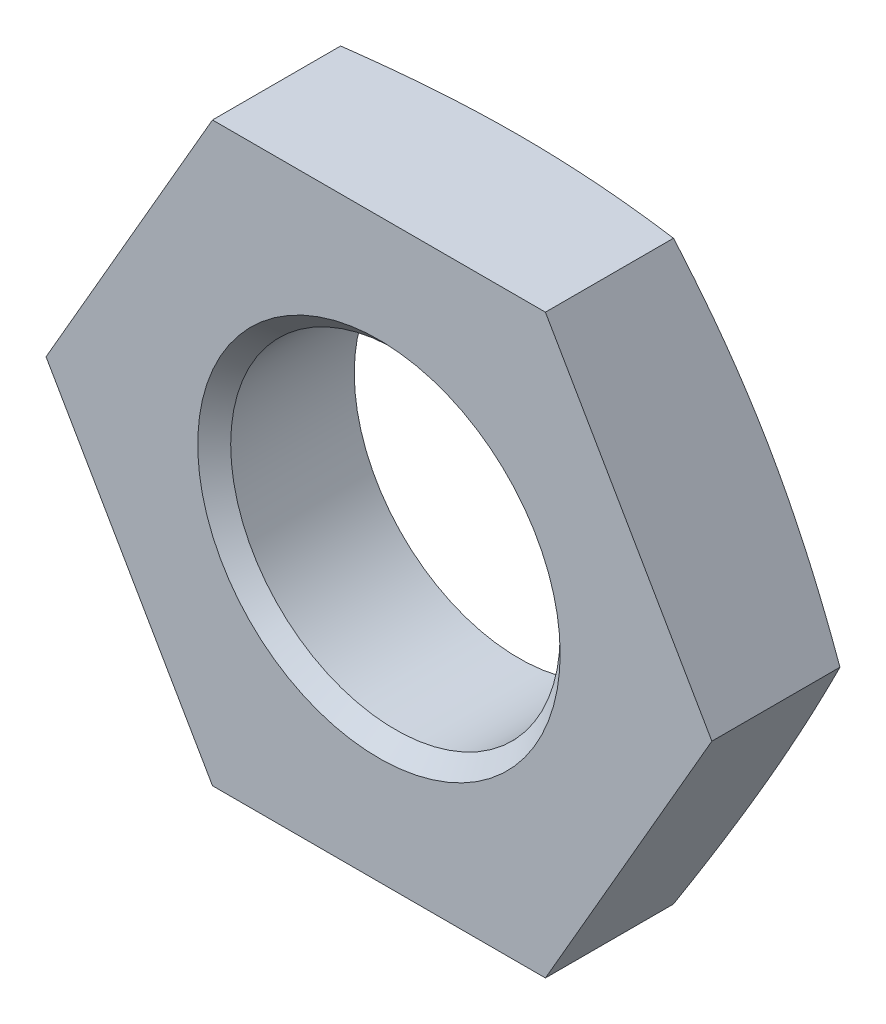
ISO-10303-21;
HEADER;
FILE_DESCRIPTION(('STEP AP214'),'2;1');
FILE_NAME('part.step','',(''),(''),'','','');
FILE_SCHEMA(('AUTOMOTIVE_DESIGN { 1 0 10303 214 1 1 1 1 }'));
ENDSEC;
DATA;
#1=APPLICATION_CONTEXT('core data for automotive mechanical design processes');
#2=APPLICATION_PROTOCOL_DEFINITION('international standard','automotive_design',2000,#1);
#3=PRODUCT_CONTEXT('',#1,'mechanical');
#4=PRODUCT('Part','Part','',(#3));
#5=PRODUCT_RELATED_PRODUCT_CATEGORY('part','',(#4));
#6=PRODUCT_DEFINITION_FORMATION('','',#4);
#7=PRODUCT_DEFINITION_CONTEXT('part definition',#1,'design');
#8=PRODUCT_DEFINITION('design','',#6,#7);
#9=PRODUCT_DEFINITION_SHAPE('','',#8);
#10=(LENGTH_UNIT() NAMED_UNIT(*) SI_UNIT(.MILLI.,.METRE.));
#11=(NAMED_UNIT(*) PLANE_ANGLE_UNIT() SI_UNIT($,.RADIAN.));
#12=(NAMED_UNIT(*) SI_UNIT($,.STERADIAN.) SOLID_ANGLE_UNIT());
#13=UNCERTAINTY_MEASURE_WITH_UNIT(LENGTH_MEASURE(1.E-05),#10,'distance_accuracy_value','');
#14=(GEOMETRIC_REPRESENTATION_CONTEXT(3) GLOBAL_UNCERTAINTY_ASSIGNED_CONTEXT((#13)) GLOBAL_UNIT_ASSIGNED_CONTEXT((#10,
#11,#12)) REPRESENTATION_CONTEXT('',''));
#15=CARTESIAN_POINT('',(0.,0.,0.));
#16=DIRECTION('',(0.,0.,1.));
#17=DIRECTION('',(1.,0.,0.));
#18=AXIS2_PLACEMENT_3D('',#15,#16,#17);
#19=CARTESIAN_POINT('',(-2.02072594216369,-3.5,-1.7));
#20=DIRECTION('',(0.,-1.,0.));
#21=DIRECTION('',(0.,0.,-1.));
#22=AXIS2_PLACEMENT_3D('',#19,#20,#21);
#23=PLANE('',#22);
#24=CARTESIAN_POINT('',(-5.34250540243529,-3.5,-0.926460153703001));
#25=CARTESIAN_POINT('',(-5.18375511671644,-3.5,-0.962032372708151));
#26=CARTESIAN_POINT('',(-5.02490552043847,-3.5,-0.997168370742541));
#27=CARTESIAN_POINT('',(-4.70695877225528,-3.5,-1.06633415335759));
#28=CARTESIAN_POINT('',(-4.5478616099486,-3.5,-1.10036389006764));
#29=CARTESIAN_POINT('',(-4.22922785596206,-3.5,-1.16711307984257));
#30=CARTESIAN_POINT('',(-4.06969098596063,-3.5,-1.1998312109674));
#31=CARTESIAN_POINT('',(-3.75028550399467,-3.5,-1.26359691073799));
#32=CARTESIAN_POINT('',(-3.59041689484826,-3.5,-1.29464449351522));
#33=CARTESIAN_POINT('',(-3.11278775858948,-3.5,-1.38424317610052));
#34=CARTESIAN_POINT('',(-2.7944536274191,-3.5,-1.4397960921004));
#35=CARTESIAN_POINT('',(-2.15584280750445,-3.5,-1.53857753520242));
#36=CARTESIAN_POINT('',(-1.83556646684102,-3.5,-1.58180820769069));
#37=CARTESIAN_POINT('',(-1.35186201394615,-3.5,-1.63326780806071));
#38=CARTESIAN_POINT('',(-1.18915391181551,-3.5,-1.64823562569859));
#39=CARTESIAN_POINT('',(-0.863327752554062,-3.5,-1.67279914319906));
#40=CARTESIAN_POINT('',(-0.700209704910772,-3.5,-1.6823949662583));
#41=CARTESIAN_POINT('',(-0.373802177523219,-3.5,-1.69565632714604));
#42=CARTESIAN_POINT('',(-0.210512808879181,-3.5,-1.69932454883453));
#43=CARTESIAN_POINT('',(0.116088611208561,-3.5,-1.70050481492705));
#44=CARTESIAN_POINT('',(0.27940066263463,-3.5,-1.69801686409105));
#45=CARTESIAN_POINT('',(0.60640968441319,-3.5,-1.68702500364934));
#46=CARTESIAN_POINT('',(0.77010590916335,-3.5,-1.67849935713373));
#47=CARTESIAN_POINT('',(1.09711815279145,-3.5,-1.65591780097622));
#48=CARTESIAN_POINT('',(1.26043415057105,-3.5,-1.64186159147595));
#49=CARTESIAN_POINT('',(1.58667719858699,-3.5,-1.60892981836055));
#50=CARTESIAN_POINT('',(1.74960393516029,-3.5,-1.59005119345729));
#51=CARTESIAN_POINT('',(2.07493184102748,-3.5,-1.54825406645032));
#52=CARTESIAN_POINT('',(2.23733300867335,-3.5,-1.52533555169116));
#53=CARTESIAN_POINT('',(2.70201244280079,-3.5,-1.45494463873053));
#54=CARTESIAN_POINT('',(3.00366965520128,-3.5,-1.40339226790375));
#55=CARTESIAN_POINT('',(3.60558094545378,-3.5,-1.29266255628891));
#56=CARTESIAN_POINT('',(3.90583484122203,-3.5,-1.2334842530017));
#57=CARTESIAN_POINT('',(4.50535507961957,-3.5,-1.11000595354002));
#58=CARTESIAN_POINT('',(4.80462116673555,-3.5,-1.04570472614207));
#59=CARTESIAN_POINT('',(5.40235855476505,-3.5,-0.913615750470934));
#60=CARTESIAN_POINT('',(5.70082990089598,-3.5,-0.845828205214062));
#61=CARTESIAN_POINT('',(6.29427282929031,-3.5,-0.708480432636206));
#62=CARTESIAN_POINT('',(6.58924997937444,-3.5,-0.638944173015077));
#63=CARTESIAN_POINT('',(7.17879272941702,-3.5,-0.49812969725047));
#64=CARTESIAN_POINT('',(7.47335832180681,-3.5,-0.426851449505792));
#65=CARTESIAN_POINT('',(8.06181238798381,-3.5,-0.283096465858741));
#66=CARTESIAN_POINT('',(8.35570124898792,-3.5,-0.210621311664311));
#67=CARTESIAN_POINT('',(8.94322286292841,-3.5,-0.0646806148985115));
#68=CARTESIAN_POINT('',(9.23685562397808,-3.5,0.00878489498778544));
#69=CARTESIAN_POINT('',(9.53039909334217,-3.5,0.0826012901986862));
#70=B_SPLINE_CURVE_WITH_KNOTS('',3,(#24,#25,#26,#27,#28,#29,#30,#31,#32,#33,#34,#35,#36,#37,#38,
#39,#40,#41,#42,#43,#44,#45,#46,#47,#48,#49,#50,#51,#52,#53,#54,#55,#56,#57,#58,#59,#60,#61,#62,
#63,#64,#65,#66,#67,#68,#69),.UNSPECIFIED.,.F.,.F.,(4,2,2,2,2,2,2,2,2,2,2,2,2,2,2,2,2,2,2,2,2,2,
4),(0.,0.488062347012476,0.976145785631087,1.46470938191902,1.95326884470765,2.92256552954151,
3.8916933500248,4.38180449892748,4.8719044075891,5.36178234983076,5.85165991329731,
6.34331015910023,6.83498706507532,7.32697686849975,7.8189682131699,8.7368879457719,
9.65492364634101,10.5731806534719,11.491384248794,12.4005642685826,13.3097607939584,
14.2178391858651,15.1258876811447),.UNSPECIFIED.);
#71=CARTESIAN_POINT('',(2.02072594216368,-3.5,-1.55491840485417));
#72=VERTEX_POINT('',#71);
#73=CARTESIAN_POINT('',(0.,-3.5,-1.7));
#74=VERTEX_POINT('',#73);
#75=EDGE_CURVE('E206',#72,#74,#70,.F.);
#76=ORIENTED_EDGE('',*,*,#75,.F.);
#77=DIRECTION('',(0.,0.,1.));
#78=VECTOR('',#77,1.);
#79=CARTESIAN_POINT('',(2.02072594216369,-3.5,-1.7));
#80=LINE('',#79,#78);
#81=CARTESIAN_POINT('',(2.02072594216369,-3.5,0.));
#82=VERTEX_POINT('',#81);
#83=EDGE_CURVE('E229',#72,#82,#80,.T.);
#84=ORIENTED_EDGE('',*,*,#83,.T.);
#85=DIRECTION('',(1.,0.,0.));
#86=VECTOR('',#85,1.);
#87=CARTESIAN_POINT('',(-2.02072594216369,-3.5,0.));
#88=LINE('',#87,#86);
#89=CARTESIAN_POINT('',(-2.02072594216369,-3.5,0.));
#90=VERTEX_POINT('',#89);
#91=EDGE_CURVE('E211',#90,#82,#88,.T.);
#92=ORIENTED_EDGE('',*,*,#91,.F.);
#93=DIRECTION('',(0.,0.,1.));
#94=VECTOR('',#93,1.);
#95=CARTESIAN_POINT('',(-2.02072594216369,-3.5,-1.7));
#96=LINE('',#95,#94);
#97=CARTESIAN_POINT('',(-2.02072594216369,-3.5,-1.55491840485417));
#98=VERTEX_POINT('',#97);
#99=EDGE_CURVE('E58',#98,#90,#96,.T.);
#100=ORIENTED_EDGE('',*,*,#99,.F.);
#101=EDGE_CURVE('E201',#74,#98,#70,.F.);
#102=ORIENTED_EDGE('',*,*,#101,.F.);
#103=EDGE_LOOP('',(#76,#84,#92,#100,#102));
#104=FACE_BOUND('',#103,.T.);
#105=ADVANCED_FACE('F35',(#104),#23,.T.);
#106=CARTESIAN_POINT('',(-4.04145188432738,0.,-1.7));
#107=DIRECTION('',(-0.866025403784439,-0.5,0.));
#108=DIRECTION('',(0.5,-0.866025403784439,0.));
#109=AXIS2_PLACEMENT_3D('',#106,#107,#108);
#110=PLANE('',#109);
#111=CARTESIAN_POINT('',(-2.02061047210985,-3.5002,-1.55488746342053));
#112=CARTESIAN_POINT('',(-2.10453570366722,-3.35483723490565,-1.57738559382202));
#113=CARTESIAN_POINT('',(-2.18861311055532,-3.20921089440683,-1.59781025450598));
#114=CARTESIAN_POINT('',(-2.35706487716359,-2.91744387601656,-1.63369455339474));
#115=CARTESIAN_POINT('',(-2.44143934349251,-2.77130301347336,-1.64915217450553));
#116=CARTESIAN_POINT('',(-2.6099736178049,-2.47939308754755,-1.67419991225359));
#117=CARTESIAN_POINT('',(-2.69413228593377,-2.33362599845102,-1.68381990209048));
#118=CARTESIAN_POINT('',(-2.86255695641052,-2.04190591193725,-1.69671933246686));
#119=CARTESIAN_POINT('',(-2.94682293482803,-1.89595295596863,-1.7));
#120=CARTESIAN_POINT('',(-3.11535489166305,-1.60404704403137,-1.7));
#121=CARTESIAN_POINT('',(-3.19962087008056,-1.45809408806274,-1.69671933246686));
#122=CARTESIAN_POINT('',(-3.3680455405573,-1.16637400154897,-1.68381990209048));
#123=CARTESIAN_POINT('',(-3.45220420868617,-1.02060691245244,-1.67419991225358));
#124=CARTESIAN_POINT('',(-3.62073848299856,-0.728696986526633,-1.64915217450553));
#125=CARTESIAN_POINT('',(-3.70511294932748,-0.582556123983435,-1.63369455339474));
#126=CARTESIAN_POINT('',(-3.87356471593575,-0.29078910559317,-1.59781025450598));
#127=CARTESIAN_POINT('',(-3.95764212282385,-0.145162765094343,-1.57738559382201));
#128=CARTESIAN_POINT('',(-4.04156735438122,0.000200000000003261,-1.55488746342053));
#129=B_SPLINE_CURVE_WITH_KNOTS('',3,(#111,#112,#113,#114,#115,#116,#117,#118,#119,#120,#121,
#122,#123,#124,#125,#126,#127,#128),.UNSPECIFIED.,.F.,.F.,(4,2,2,2,2,2,2,2,4),(0.,
0.508081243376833,1.016368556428,1.52203235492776,2.02759827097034,2.53316418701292,
3.03882798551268,3.54711529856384,4.05519654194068),.UNSPECIFIED.);
#130=CARTESIAN_POINT('',(-3.03108891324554,-1.75,-1.7));
#131=VERTEX_POINT('',#130);
#132=EDGE_CURVE('E207',#98,#131,#129,.T.);
#133=ORIENTED_EDGE('',*,*,#132,.F.);
#134=ORIENTED_EDGE('',*,*,#99,.T.);
#135=DIRECTION('',(0.5,-0.866025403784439,0.));
#136=VECTOR('',#135,1.);
#137=CARTESIAN_POINT('',(-4.04145188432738,0.,0.));
#138=LINE('',#137,#136);
#139=CARTESIAN_POINT('',(-4.04145188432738,0.,0.));
#140=VERTEX_POINT('',#139);
#141=EDGE_CURVE('E226',#140,#90,#138,.T.);
#142=ORIENTED_EDGE('',*,*,#141,.F.);
#143=DIRECTION('',(0.,0.,1.));
#144=VECTOR('',#143,1.);
#145=CARTESIAN_POINT('',(-4.04145188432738,0.,-1.7));
#146=LINE('',#145,#144);
#147=CARTESIAN_POINT('',(-4.04145188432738,0.,-1.55491840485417));
#148=VERTEX_POINT('',#147);
#149=EDGE_CURVE('E231',#148,#140,#146,.T.);
#150=ORIENTED_EDGE('',*,*,#149,.F.);
#151=EDGE_CURVE('E117',#131,#148,#129,.T.);
#152=ORIENTED_EDGE('',*,*,#151,.F.);
#153=EDGE_LOOP('',(#133,#134,#142,#150,#152));
#154=FACE_BOUND('',#153,.T.);
#155=ADVANCED_FACE('F199',(#154),#110,.T.);
#156=CARTESIAN_POINT('',(-2.02072594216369,3.5,-1.7));
#157=DIRECTION('',(-0.866025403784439,0.5,0.));
#158=DIRECTION('',(-0.5,-0.866025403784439,0.));
#159=AXIS2_PLACEMENT_3D('',#156,#157,#158);
#160=PLANE('',#159);
#161=CARTESIAN_POINT('',(-4.04156735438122,-0.00019999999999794,-1.55488746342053));
#162=CARTESIAN_POINT('',(-3.95764212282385,0.145162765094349,-1.57738559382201));
#163=CARTESIAN_POINT('',(-3.87356471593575,0.290789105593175,-1.59781025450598));
#164=CARTESIAN_POINT('',(-3.70511294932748,0.58255612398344,-1.63369455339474));
#165=CARTESIAN_POINT('',(-3.62073848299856,0.728696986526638,-1.64915217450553));
#166=CARTESIAN_POINT('',(-3.45220420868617,1.02060691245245,-1.67419991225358));
#167=CARTESIAN_POINT('',(-3.3680455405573,1.16637400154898,-1.68381990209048));
#168=CARTESIAN_POINT('',(-3.19962087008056,1.45809408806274,-1.69671933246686));
#169=CARTESIAN_POINT('',(-3.11535489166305,1.60404704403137,-1.7));
#170=CARTESIAN_POINT('',(-2.94682293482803,1.89595295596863,-1.7));
#171=CARTESIAN_POINT('',(-2.86255695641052,2.04190591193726,-1.69671933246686));
#172=CARTESIAN_POINT('',(-2.69413228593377,2.33362599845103,-1.68381990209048));
#173=CARTESIAN_POINT('',(-2.6099736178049,2.47939308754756,-1.67419991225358));
#174=CARTESIAN_POINT('',(-2.44143934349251,2.77130301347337,-1.64915217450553));
#175=CARTESIAN_POINT('',(-2.35706487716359,2.91744387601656,-1.63369455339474));
#176=CARTESIAN_POINT('',(-2.18861311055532,3.20921089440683,-1.59781025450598));
#177=CARTESIAN_POINT('',(-2.10453570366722,3.35483723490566,-1.57738559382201));
#178=CARTESIAN_POINT('',(-2.02061047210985,3.5002,-1.55488746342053));
#179=B_SPLINE_CURVE_WITH_KNOTS('',3,(#161,#162,#163,#164,#165,#166,#167,#168,#169,#170,#171,
#172,#173,#174,#175,#176,#177,#178),.UNSPECIFIED.,.F.,.F.,(4,2,2,2,2,2,2,2,4),(0.,
0.508081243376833,1.01636855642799,1.52203235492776,2.02759827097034,2.53316418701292,
3.03882798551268,3.54711529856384,4.05519654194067),.UNSPECIFIED.);
#180=CARTESIAN_POINT('',(-3.03108891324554,1.75,-1.7));
#181=VERTEX_POINT('',#180);
#182=EDGE_CURVE('E110',#148,#181,#179,.T.);
#183=ORIENTED_EDGE('',*,*,#182,.F.);
#184=ORIENTED_EDGE('',*,*,#149,.T.);
#185=DIRECTION('',(-0.5,-0.866025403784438,0.));
#186=VECTOR('',#185,1.);
#187=CARTESIAN_POINT('',(-2.02072594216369,3.5,0.));
#188=LINE('',#187,#186);
#189=CARTESIAN_POINT('',(-2.02072594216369,3.5,0.));
#190=VERTEX_POINT('',#189);
#191=EDGE_CURVE('E223',#190,#140,#188,.T.);
#192=ORIENTED_EDGE('',*,*,#191,.F.);
#193=DIRECTION('',(0.,0.,1.));
#194=VECTOR('',#193,1.);
#195=CARTESIAN_POINT('',(-2.02072594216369,3.5,-1.7));
#196=LINE('',#195,#194);
#197=CARTESIAN_POINT('',(-2.02072594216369,3.5,-1.55491840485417));
#198=VERTEX_POINT('',#197);
#199=EDGE_CURVE('E141',#198,#190,#196,.T.);
#200=ORIENTED_EDGE('',*,*,#199,.F.);
#201=EDGE_CURVE('E121',#181,#198,#179,.T.);
#202=ORIENTED_EDGE('',*,*,#201,.F.);
#203=EDGE_LOOP('',(#183,#184,#192,#200,#202));
#204=FACE_BOUND('',#203,.T.);
#205=ADVANCED_FACE('F139',(#204),#160,.T.);
#206=CARTESIAN_POINT('',(2.02072594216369,3.5,-1.7));
#207=DIRECTION('',(0.,1.,0.));
#208=DIRECTION('',(0.,0.,1.));
#209=AXIS2_PLACEMENT_3D('',#206,#207,#208);
#210=PLANE('',#209);
#211=CARTESIAN_POINT('',(-5.34250540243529,3.5,-0.926460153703));
#212=CARTESIAN_POINT('',(-5.18375511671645,3.5,-0.962032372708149));
#213=CARTESIAN_POINT('',(-5.02490552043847,3.5,-0.997168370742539));
#214=CARTESIAN_POINT('',(-4.70695877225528,3.5,-1.06633415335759));
#215=CARTESIAN_POINT('',(-4.5478616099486,3.5,-1.10036389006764));
#216=CARTESIAN_POINT('',(-4.22922785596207,3.5,-1.16711307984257));
#217=CARTESIAN_POINT('',(-4.06969098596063,3.5,-1.1998312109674));
#218=CARTESIAN_POINT('',(-3.75028550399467,3.5,-1.26359691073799));
#219=CARTESIAN_POINT('',(-3.59041689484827,3.5,-1.29464449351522));
#220=CARTESIAN_POINT('',(-3.11278775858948,3.5,-1.38424317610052));
#221=CARTESIAN_POINT('',(-2.7944536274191,3.5,-1.4397960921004));
#222=CARTESIAN_POINT('',(-2.15584280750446,3.5,-1.53857753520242));
#223=CARTESIAN_POINT('',(-1.83556646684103,3.5,-1.58180820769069));
#224=CARTESIAN_POINT('',(-1.35186201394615,3.5,-1.63326780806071));
#225=CARTESIAN_POINT('',(-1.18915391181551,3.5,-1.64823562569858));
#226=CARTESIAN_POINT('',(-0.863327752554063,3.5,-1.67279914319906));
#227=CARTESIAN_POINT('',(-0.700209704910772,3.5,-1.68239496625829));
#228=CARTESIAN_POINT('',(-0.373802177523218,3.5,-1.69565632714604));
#229=CARTESIAN_POINT('',(-0.21051280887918,3.5,-1.69932454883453));
#230=CARTESIAN_POINT('',(0.116088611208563,3.5,-1.70050481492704));
#231=CARTESIAN_POINT('',(0.279400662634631,3.5,-1.69801686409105));
#232=CARTESIAN_POINT('',(0.606409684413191,3.5,-1.68702500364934));
#233=CARTESIAN_POINT('',(0.770105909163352,3.5,-1.67849935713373));
#234=CARTESIAN_POINT('',(1.09711815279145,3.5,-1.65591780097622));
#235=CARTESIAN_POINT('',(1.26043415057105,3.5,-1.64186159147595));
#236=CARTESIAN_POINT('',(1.58667719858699,3.5,-1.60892981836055));
#237=CARTESIAN_POINT('',(1.74960393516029,3.5,-1.59005119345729));
#238=CARTESIAN_POINT('',(2.07493184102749,3.5,-1.54825406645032));
#239=CARTESIAN_POINT('',(2.23733300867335,3.5,-1.52533555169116));
#240=CARTESIAN_POINT('',(2.7020124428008,3.5,-1.45494463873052));
#241=CARTESIAN_POINT('',(3.00366965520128,3.5,-1.40339226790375));
#242=CARTESIAN_POINT('',(3.60558094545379,3.5,-1.29266255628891));
#243=CARTESIAN_POINT('',(3.90583484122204,3.5,-1.2334842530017));
#244=CARTESIAN_POINT('',(4.50535507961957,3.5,-1.11000595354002));
#245=CARTESIAN_POINT('',(4.80462116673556,3.5,-1.04570472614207));
#246=CARTESIAN_POINT('',(5.40235855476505,3.5,-0.913615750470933));
#247=CARTESIAN_POINT('',(5.70082990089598,3.5,-0.84582820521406));
#248=CARTESIAN_POINT('',(6.29427282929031,3.5,-0.708480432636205));
#249=CARTESIAN_POINT('',(6.58924997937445,3.5,-0.638944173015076));
#250=CARTESIAN_POINT('',(7.17879272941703,3.5,-0.498129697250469));
#251=CARTESIAN_POINT('',(7.47335832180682,3.5,-0.426851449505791));
#252=CARTESIAN_POINT('',(8.06181238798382,3.5,-0.28309646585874));
#253=CARTESIAN_POINT('',(8.35570124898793,3.5,-0.21062131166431));
#254=CARTESIAN_POINT('',(8.94322286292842,3.5,-0.0646806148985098));
#255=CARTESIAN_POINT('',(9.23685562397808,3.5,0.00878489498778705));
#256=CARTESIAN_POINT('',(9.53039909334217,3.5,0.0826012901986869));
#257=B_SPLINE_CURVE_WITH_KNOTS('',3,(#211,#212,#213,#214,#215,#216,#217,#218,#219,#220,#221,
#222,#223,#224,#225,#226,#227,#228,#229,#230,#231,#232,#233,#234,#235,#236,#237,#238,#239,#240,
#241,#242,#243,#244,#245,#246,#247,#248,#249,#250,#251,#252,#253,#254,#255,#256),.UNSPECIFIED.,
.F.,.F.,(4,2,2,2,2,2,2,2,2,2,2,2,2,2,2,2,2,2,2,2,2,2,4),(0.,0.488062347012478,0.97614578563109,
1.46470938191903,1.95326884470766,2.92256552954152,3.8916933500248,4.38180449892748,
4.8719044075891,5.36178234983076,5.85165991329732,6.34331015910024,6.83498706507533,
7.32697686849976,7.81896821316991,8.73688794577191,9.65492364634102,10.5731806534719,
11.491384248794,12.4005642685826,13.3097607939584,14.2178391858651,15.1258876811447),.UNSPECIFIED.);
#258=CARTESIAN_POINT('',(0.,3.5,-1.7));
#259=VERTEX_POINT('',#258);
#260=EDGE_CURVE('E128',#198,#259,#257,.T.);
#261=ORIENTED_EDGE('',*,*,#260,.F.);
#262=ORIENTED_EDGE('',*,*,#199,.T.);
#263=DIRECTION('',(-1.,0.,0.));
#264=VECTOR('',#263,1.);
#265=CARTESIAN_POINT('',(2.02072594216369,3.5,0.));
#266=LINE('',#265,#264);
#267=CARTESIAN_POINT('',(2.02072594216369,3.5,0.));
#268=VERTEX_POINT('',#267);
#269=EDGE_CURVE('E220',#268,#190,#266,.T.);
#270=ORIENTED_EDGE('',*,*,#269,.F.);
#271=DIRECTION('',(0.,0.,1.));
#272=VECTOR('',#271,1.);
#273=CARTESIAN_POINT('',(2.02072594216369,3.5,-1.7));
#274=LINE('',#273,#272);
#275=CARTESIAN_POINT('',(2.02072594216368,3.50000000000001,-1.55491840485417));
#276=VERTEX_POINT('',#275);
#277=EDGE_CURVE('E234',#276,#268,#274,.T.);
#278=ORIENTED_EDGE('',*,*,#277,.F.);
#279=EDGE_CURVE('E142',#259,#276,#257,.T.);
#280=ORIENTED_EDGE('',*,*,#279,.F.);
#281=EDGE_LOOP('',(#261,#262,#270,#278,#280));
#282=FACE_BOUND('',#281,.T.);
#283=ADVANCED_FACE('F191',(#282),#210,.T.);
#284=CARTESIAN_POINT('',(4.04145188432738,0.,-1.7));
#285=DIRECTION('',(0.866025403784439,0.5,0.));
#286=DIRECTION('',(-0.5,0.866025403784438,0.));
#287=AXIS2_PLACEMENT_3D('',#284,#285,#286);
#288=PLANE('',#287);
#289=CARTESIAN_POINT('',(2.02061047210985,3.5002,-1.55488746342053));
#290=CARTESIAN_POINT('',(2.10453570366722,3.35483723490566,-1.57738559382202));
#291=CARTESIAN_POINT('',(2.18861311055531,3.20921089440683,-1.59781025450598));
#292=CARTESIAN_POINT('',(2.35706487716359,2.91744387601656,-1.63369455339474));
#293=CARTESIAN_POINT('',(2.44143934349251,2.77130301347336,-1.64915217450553));
#294=CARTESIAN_POINT('',(2.6099736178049,2.47939308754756,-1.67419991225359));
#295=CARTESIAN_POINT('',(2.69413228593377,2.33362599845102,-1.68381990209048));
#296=CARTESIAN_POINT('',(2.86255695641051,2.04190591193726,-1.69671933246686));
#297=CARTESIAN_POINT('',(2.94682293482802,1.89595295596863,-1.7));
#298=CARTESIAN_POINT('',(3.11535489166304,1.60404704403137,-1.7));
#299=CARTESIAN_POINT('',(3.19962087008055,1.45809408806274,-1.69671933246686));
#300=CARTESIAN_POINT('',(3.36804554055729,1.16637400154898,-1.68381990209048));
#301=CARTESIAN_POINT('',(3.45220420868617,1.02060691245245,-1.67419991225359));
#302=CARTESIAN_POINT('',(3.62073848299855,0.728696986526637,-1.64915217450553));
#303=CARTESIAN_POINT('',(3.70511294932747,0.582556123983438,-1.63369455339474));
#304=CARTESIAN_POINT('',(3.87356471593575,0.290789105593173,-1.59781025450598));
#305=CARTESIAN_POINT('',(3.95764212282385,0.145162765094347,-1.57738559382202));
#306=CARTESIAN_POINT('',(4.04156735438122,-0.000199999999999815,-1.55488746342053));
#307=B_SPLINE_CURVE_WITH_KNOTS('',3,(#289,#290,#291,#292,#293,#294,#295,#296,#297,#298,#299,
#300,#301,#302,#303,#304,#305,#306),.UNSPECIFIED.,.F.,.F.,(4,2,2,2,2,2,2,2,4),(0.,
0.508081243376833,1.016368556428,1.52203235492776,2.02759827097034,2.53316418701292,
3.03882798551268,3.54711529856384,4.05519654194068),.UNSPECIFIED.);
#308=CARTESIAN_POINT('',(3.03108891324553,1.75,-1.7));
#309=VERTEX_POINT('',#308);
#310=EDGE_CURVE('E185',#276,#309,#307,.T.);
#311=ORIENTED_EDGE('',*,*,#310,.F.);
#312=ORIENTED_EDGE('',*,*,#277,.T.);
#313=DIRECTION('',(-0.5,0.866025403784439,0.));
#314=VECTOR('',#313,1.);
#315=CARTESIAN_POINT('',(4.04145188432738,0.,0.));
#316=LINE('',#315,#314);
#317=CARTESIAN_POINT('',(4.04145188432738,0.,0.));
#318=VERTEX_POINT('',#317);
#319=EDGE_CURVE('E217',#318,#268,#316,.T.);
#320=ORIENTED_EDGE('',*,*,#319,.F.);
#321=DIRECTION('',(0.,0.,1.));
#322=VECTOR('',#321,1.);
#323=CARTESIAN_POINT('',(4.04145188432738,0.,-1.7));
#324=LINE('',#323,#322);
#325=CARTESIAN_POINT('',(4.04145188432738,0.,-1.55491840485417));
#326=VERTEX_POINT('',#325);
#327=EDGE_CURVE('E236',#326,#318,#324,.T.);
#328=ORIENTED_EDGE('',*,*,#327,.F.);
#329=EDGE_CURVE('E179',#309,#326,#307,.T.);
#330=ORIENTED_EDGE('',*,*,#329,.F.);
#331=EDGE_LOOP('',(#311,#312,#320,#328,#330));
#332=FACE_BOUND('',#331,.T.);
#333=ADVANCED_FACE('F187',(#332),#288,.T.);
#334=CARTESIAN_POINT('',(2.02072594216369,-3.5,-1.7));
#335=DIRECTION('',(0.866025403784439,-0.5,0.));
#336=DIRECTION('',(0.5,0.866025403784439,0.));
#337=AXIS2_PLACEMENT_3D('',#334,#335,#336);
#338=PLANE('',#337);
#339=CARTESIAN_POINT('',(4.04156735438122,0.000200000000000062,-1.55488746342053));
#340=CARTESIAN_POINT('',(3.95764212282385,-0.145162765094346,-1.57738559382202));
#341=CARTESIAN_POINT('',(3.87356471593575,-0.290789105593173,-1.59781025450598));
#342=CARTESIAN_POINT('',(3.70511294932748,-0.582556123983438,-1.63369455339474));
#343=CARTESIAN_POINT('',(3.62073848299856,-0.728696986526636,-1.64915217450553));
#344=CARTESIAN_POINT('',(3.45220420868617,-1.02060691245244,-1.67419991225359));
#345=CARTESIAN_POINT('',(3.3680455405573,-1.16637400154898,-1.68381990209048));
#346=CARTESIAN_POINT('',(3.19962087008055,-1.45809408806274,-1.69671933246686));
#347=CARTESIAN_POINT('',(3.11535489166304,-1.60404704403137,-1.7));
#348=CARTESIAN_POINT('',(2.94682293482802,-1.89595295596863,-1.7));
#349=CARTESIAN_POINT('',(2.86255695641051,-2.04190591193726,-1.69671933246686));
#350=CARTESIAN_POINT('',(2.69413228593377,-2.33362599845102,-1.68381990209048));
#351=CARTESIAN_POINT('',(2.6099736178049,-2.47939308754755,-1.67419991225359));
#352=CARTESIAN_POINT('',(2.44143934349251,-2.77130301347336,-1.64915217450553));
#353=CARTESIAN_POINT('',(2.35706487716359,-2.91744387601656,-1.63369455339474));
#354=CARTESIAN_POINT('',(2.18861311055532,-3.20921089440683,-1.59781025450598));
#355=CARTESIAN_POINT('',(2.10453570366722,-3.35483723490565,-1.57738559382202));
#356=CARTESIAN_POINT('',(2.02061047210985,-3.5002,-1.55488746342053));
#357=B_SPLINE_CURVE_WITH_KNOTS('',3,(#339,#340,#341,#342,#343,#344,#345,#346,#347,#348,#349,
#350,#351,#352,#353,#354,#355,#356),.UNSPECIFIED.,.F.,.F.,(4,2,2,2,2,2,2,2,4),(0.,
0.508081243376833,1.01636855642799,1.52203235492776,2.02759827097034,2.53316418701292,
3.03882798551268,3.54711529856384,4.05519654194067),.UNSPECIFIED.);
#358=CARTESIAN_POINT('',(3.03108891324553,-1.75,-1.7));
#359=VERTEX_POINT('',#358);
#360=EDGE_CURVE('E186',#326,#359,#357,.T.);
#361=ORIENTED_EDGE('',*,*,#360,.F.);
#362=ORIENTED_EDGE('',*,*,#327,.T.);
#363=DIRECTION('',(0.5,0.866025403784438,0.));
#364=VECTOR('',#363,1.);
#365=CARTESIAN_POINT('',(2.02072594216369,-3.5,0.));
#366=LINE('',#365,#364);
#367=EDGE_CURVE('E214',#82,#318,#366,.T.);
#368=ORIENTED_EDGE('',*,*,#367,.F.);
#369=ORIENTED_EDGE('',*,*,#83,.F.);
#370=EDGE_CURVE('E131',#359,#72,#357,.T.);
#371=ORIENTED_EDGE('',*,*,#370,.F.);
#372=EDGE_LOOP('',(#361,#362,#368,#369,#371));
#373=FACE_BOUND('',#372,.T.);
#374=ADVANCED_FACE('F190',(#373),#338,.T.);
#375=CARTESIAN_POINT('',(2.02072594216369,-3.5,-1.7));
#376=DIRECTION('',(0.,0.,1.));
#377=DIRECTION('',(1.,0.,0.));
#378=AXIS2_PLACEMENT_3D('',#375,#376,#377);
#379=PLANE('',#378);
#380=CARTESIAN_POINT('',(0.,0.,-1.7));
#381=DIRECTION('',(0.,0.,1.));
#382=DIRECTION('',(1.,0.,0.));
#383=AXIS2_PLACEMENT_3D('',#380,#381,#382);
#384=CIRCLE('',#383,2.);
#385=CARTESIAN_POINT('',(2.,0.,-1.7));
#386=VERTEX_POINT('',#385);
#387=EDGE_CURVE('E208',#386,#386,#384,.T.);
#388=ORIENTED_EDGE('',*,*,#387,.T.);
#389=EDGE_LOOP('',(#388));
#390=FACE_BOUND('',#389,.T.);
#391=CARTESIAN_POINT('',(0.,0.,-1.7));
#392=DIRECTION('',(0.,0.,1.));
#393=DIRECTION('',(1.,0.,0.));
#394=AXIS2_PLACEMENT_3D('',#391,#392,#393);
#395=CIRCLE('',#394,3.5);
#396=EDGE_CURVE('E50',#309,#359,#395,.F.);
#397=ORIENTED_EDGE('',*,*,#396,.T.);
#398=EDGE_CURVE('E238',#359,#74,#395,.F.);
#399=ORIENTED_EDGE('',*,*,#398,.T.);
#400=EDGE_CURVE('E135',#74,#131,#395,.F.);
#401=ORIENTED_EDGE('',*,*,#400,.T.);
#402=EDGE_CURVE('E114',#131,#181,#395,.F.);
#403=ORIENTED_EDGE('',*,*,#402,.T.);
#404=CARTESIAN_POINT('',(0.,0.,-1.7));
#405=DIRECTION('',(0.,0.,-1.));
#406=DIRECTION('',(-1.,0.,0.));
#407=AXIS2_PLACEMENT_3D('',#404,#405,#406);
#408=CIRCLE('',#407,3.5);
#409=EDGE_CURVE('E125',#181,#259,#408,.T.);
#410=ORIENTED_EDGE('',*,*,#409,.T.);
#411=EDGE_CURVE('E136',#259,#309,#395,.F.);
#412=ORIENTED_EDGE('',*,*,#411,.T.);
#413=EDGE_LOOP('',(#397,#399,#401,#403,#410,#412));
#414=FACE_BOUND('',#413,.T.);
#415=ADVANCED_FACE('F133',(#390,#414),#379,.F.);
#416=CARTESIAN_POINT('',(2.02072594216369,-3.5,0.));
#417=DIRECTION('',(0.,0.,1.));
#418=DIRECTION('',(1.,0.,0.));
#419=AXIS2_PLACEMENT_3D('',#416,#417,#418);
#420=PLANE('',#419);
#421=CARTESIAN_POINT('',(0.,0.,0.));
#422=DIRECTION('',(0.,0.,1.));
#423=DIRECTION('',(1.,0.,0.));
#424=AXIS2_PLACEMENT_3D('',#421,#422,#423);
#425=CIRCLE('',#424,2.2);
#426=CARTESIAN_POINT('',(2.2,0.,0.));
#427=VERTEX_POINT('',#426);
#428=EDGE_CURVE('E11',#427,#427,#425,.F.);
#429=ORIENTED_EDGE('',*,*,#428,.T.);
#430=EDGE_LOOP('',(#429));
#431=FACE_BOUND('',#430,.T.);
#432=ORIENTED_EDGE('',*,*,#91,.T.);
#433=ORIENTED_EDGE('',*,*,#367,.T.);
#434=ORIENTED_EDGE('',*,*,#319,.T.);
#435=ORIENTED_EDGE('',*,*,#269,.T.);
#436=ORIENTED_EDGE('',*,*,#191,.T.);
#437=ORIENTED_EDGE('',*,*,#141,.T.);
#438=EDGE_LOOP('',(#432,#433,#434,#435,#436,#437));
#439=FACE_BOUND('',#438,.T.);
#440=ADVANCED_FACE('F251',(#431,#439),#420,.T.);
#441=CARTESIAN_POINT('',(0.,0.,-1.7));
#442=DIRECTION('',(0.,0.,1.));
#443=DIRECTION('',(1.,0.,0.));
#444=AXIS2_PLACEMENT_3D('',#441,#442,#443);
#445=CYLINDRICAL_SURFACE('',#444,2.);
#446=CARTESIAN_POINT('',(0.,0.,-0.199999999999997));
#447=DIRECTION('',(0.,0.,1.));
#448=DIRECTION('',(1.,0.,0.));
#449=AXIS2_PLACEMENT_3D('',#446,#447,#448);
#450=CIRCLE('',#449,2.);
#451=CARTESIAN_POINT('',(2.,0.,-0.199999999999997));
#452=VERTEX_POINT('',#451);
#453=EDGE_CURVE('E43',#452,#452,#450,.T.);
#454=ORIENTED_EDGE('',*,*,#453,.T.);
#455=EDGE_LOOP('',(#454));
#456=FACE_BOUND('',#455,.T.);
#457=ORIENTED_EDGE('',*,*,#387,.F.);
#458=EDGE_LOOP('',(#457));
#459=FACE_BOUND('',#458,.T.);
#460=ADVANCED_FACE('F166',(#456,#459),#445,.F.);
#461=CARTESIAN_POINT('',(0.,0.,-1.55491840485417));
#462=DIRECTION('',(0.,0.,1.));
#463=DIRECTION('',(1.,0.,0.));
#464=AXIS2_PLACEMENT_3D('',#461,#462,#463);
#465=CONICAL_SURFACE('',#464,4.04145188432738,1.30899693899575);
#466=ORIENTED_EDGE('',*,*,#329,.T.);
#467=ORIENTED_EDGE('',*,*,#360,.T.);
#468=ORIENTED_EDGE('',*,*,#396,.F.);
#469=EDGE_LOOP('',(#466,#467,#468));
#470=FACE_BOUND('',#469,.T.);
#471=ADVANCED_FACE('F161',(#470),#465,.T.);
#472=ORIENTED_EDGE('',*,*,#279,.T.);
#473=ORIENTED_EDGE('',*,*,#310,.T.);
#474=ORIENTED_EDGE('',*,*,#411,.F.);
#475=EDGE_LOOP('',(#472,#473,#474));
#476=FACE_BOUND('',#475,.T.);
#477=ADVANCED_FACE('F165',(#476),#465,.T.);
#478=ORIENTED_EDGE('',*,*,#201,.T.);
#479=ORIENTED_EDGE('',*,*,#260,.T.);
#480=ORIENTED_EDGE('',*,*,#409,.F.);
#481=EDGE_LOOP('',(#478,#479,#480));
#482=FACE_BOUND('',#481,.T.);
#483=ADVANCED_FACE('F126',(#482),#465,.T.);
#484=ORIENTED_EDGE('',*,*,#151,.T.);
#485=ORIENTED_EDGE('',*,*,#182,.T.);
#486=ORIENTED_EDGE('',*,*,#402,.F.);
#487=EDGE_LOOP('',(#484,#485,#486));
#488=FACE_BOUND('',#487,.T.);
#489=ADVANCED_FACE('F112',(#488),#465,.T.);
#490=ORIENTED_EDGE('',*,*,#101,.T.);
#491=ORIENTED_EDGE('',*,*,#132,.T.);
#492=ORIENTED_EDGE('',*,*,#400,.F.);
#493=EDGE_LOOP('',(#490,#491,#492));
#494=FACE_BOUND('',#493,.T.);
#495=ADVANCED_FACE('F249',(#494),#465,.T.);
#496=ORIENTED_EDGE('',*,*,#75,.T.);
#497=ORIENTED_EDGE('',*,*,#398,.F.);
#498=ORIENTED_EDGE('',*,*,#370,.T.);
#499=EDGE_LOOP('',(#496,#497,#498));
#500=FACE_BOUND('',#499,.T.);
#501=ADVANCED_FACE('F168',(#500),#465,.T.);
#502=CARTESIAN_POINT('',(0.,0.,-0.199999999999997));
#503=DIRECTION('',(0.,0.,1.));
#504=DIRECTION('',(1.,0.,0.));
#505=AXIS2_PLACEMENT_3D('',#502,#503,#504);
#506=CONICAL_SURFACE('',#505,2.,0.785398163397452);
#507=ORIENTED_EDGE('',*,*,#428,.F.);
#508=EDGE_LOOP('',(#507));
#509=FACE_BOUND('',#508,.T.);
#510=ORIENTED_EDGE('',*,*,#453,.F.);
#511=EDGE_LOOP('',(#510));
#512=FACE_BOUND('',#511,.T.);
#513=ADVANCED_FACE('F37',(#509,#512),#506,.F.);
#514=CLOSED_SHELL('',(#105,#155,#205,#283,#333,#374,#415,#440,#460,#471,#477,#483,#489,#495,
#501,#513));
#515=MANIFOLD_SOLID_BREP('B2',#514);
#516=ADVANCED_BREP_SHAPE_REPRESENTATION('',(#18,#515),#14);
#517=SHAPE_DEFINITION_REPRESENTATION(#9,#516);
ENDSEC;
END-ISO-10303-21;
